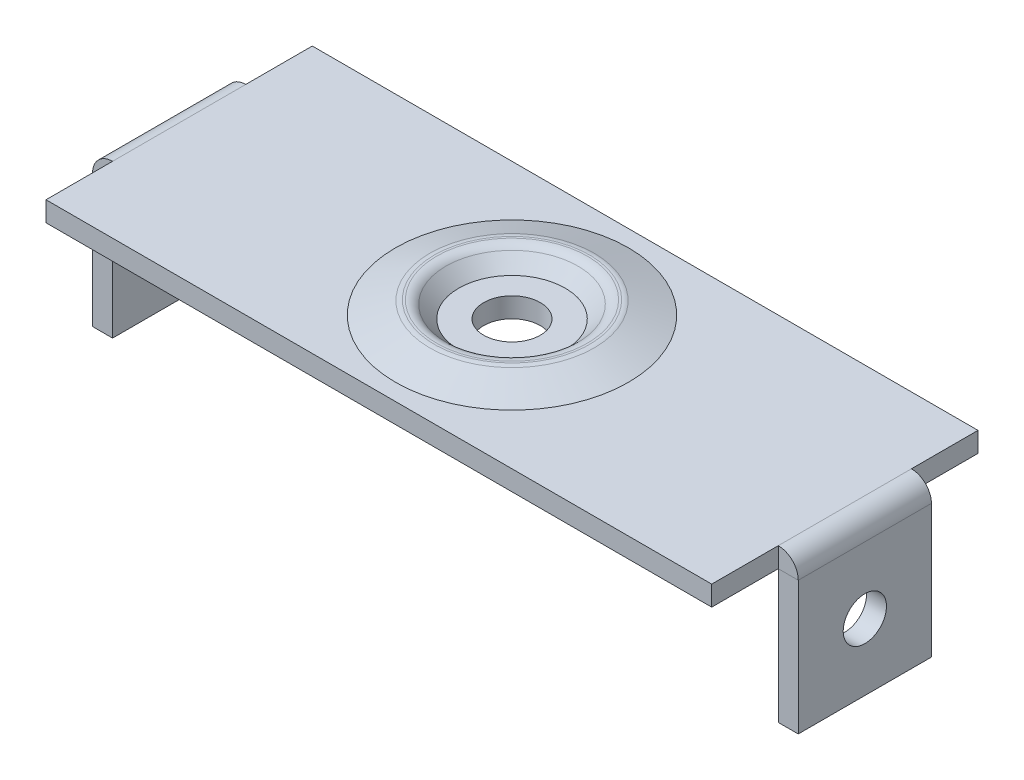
ISO-10303-21;
HEADER;
FILE_DESCRIPTION(('STEP AP214'),'2;1');
FILE_NAME('part.step','',(''),(''),'','','');
FILE_SCHEMA(('AUTOMOTIVE_DESIGN { 1 0 10303 214 1 1 1 1 }'));
ENDSEC;
DATA;
#1=APPLICATION_CONTEXT('core data for automotive mechanical design processes');
#2=APPLICATION_PROTOCOL_DEFINITION('international standard','automotive_design',2000,#1);
#3=PRODUCT_CONTEXT('',#1,'mechanical');
#4=PRODUCT('Part','Part','',(#3));
#5=PRODUCT_RELATED_PRODUCT_CATEGORY('part','',(#4));
#6=PRODUCT_DEFINITION_FORMATION('','',#4);
#7=PRODUCT_DEFINITION_CONTEXT('part definition',#1,'design');
#8=PRODUCT_DEFINITION('design','',#6,#7);
#9=PRODUCT_DEFINITION_SHAPE('','',#8);
#10=(LENGTH_UNIT() NAMED_UNIT(*) SI_UNIT(.MILLI.,.METRE.));
#11=(NAMED_UNIT(*) PLANE_ANGLE_UNIT() SI_UNIT($,.RADIAN.));
#12=(NAMED_UNIT(*) SI_UNIT($,.STERADIAN.) SOLID_ANGLE_UNIT());
#13=UNCERTAINTY_MEASURE_WITH_UNIT(LENGTH_MEASURE(1.E-05),#10,'distance_accuracy_value','');
#14=(GEOMETRIC_REPRESENTATION_CONTEXT(3) GLOBAL_UNCERTAINTY_ASSIGNED_CONTEXT((#13)) GLOBAL_UNIT_ASSIGNED_CONTEXT((#10,
#11,#12)) REPRESENTATION_CONTEXT('',''));
#15=CARTESIAN_POINT('',(0.,0.,0.));
#16=DIRECTION('',(0.,0.,1.));
#17=DIRECTION('',(1.,0.,0.));
#18=AXIS2_PLACEMENT_3D('',#15,#16,#17);
#19=CARTESIAN_POINT('',(53.,-21.5,10.));
#20=DIRECTION('',(1.,0.,0.));
#21=DIRECTION('',(0.,1.,0.));
#22=AXIS2_PLACEMENT_3D('',#19,#20,#21);
#23=PLANE('',#22);
#24=CARTESIAN_POINT('',(53.,-11.5,0.));
#25=DIRECTION('',(1.,0.,0.));
#26=DIRECTION('',(0.,1.,0.));
#27=AXIS2_PLACEMENT_3D('',#24,#25,#26);
#28=CIRCLE('',#27,3.25);
#29=CARTESIAN_POINT('',(53.,-8.24999999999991,1.11202713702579E-13));
#30=VERTEX_POINT('',#29);
#31=EDGE_CURVE('E198',#30,#30,#28,.T.);
#32=ORIENTED_EDGE('',*,*,#31,.F.);
#33=EDGE_LOOP('',(#32));
#34=FACE_BOUND('',#33,.T.);
#35=DIRECTION('',(0.,1.,0.));
#36=VECTOR('',#35,1.);
#37=CARTESIAN_POINT('',(53.,-21.5,-9.9999999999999));
#38=LINE('',#37,#36);
#39=CARTESIAN_POINT('',(53.,-21.5,-9.9999999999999));
#40=VERTEX_POINT('',#39);
#41=CARTESIAN_POINT('',(53.,-1.49999999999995,-9.99999999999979));
#42=VERTEX_POINT('',#41);
#43=EDGE_CURVE('E192',#40,#42,#38,.T.);
#44=ORIENTED_EDGE('',*,*,#43,.T.);
#45=DIRECTION('',(0.,0.,1.));
#46=VECTOR('',#45,1.);
#47=CARTESIAN_POINT('',(53.,-1.49999999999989,20.0000000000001));
#48=LINE('',#47,#46);
#49=CARTESIAN_POINT('',(53.,-1.5,10.0000000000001));
#50=VERTEX_POINT('',#49);
#51=EDGE_CURVE('E190',#42,#50,#48,.T.);
#52=ORIENTED_EDGE('',*,*,#51,.T.);
#53=DIRECTION('',(0.,1.,0.));
#54=VECTOR('',#53,1.);
#55=CARTESIAN_POINT('',(53.,-21.5,10.));
#56=LINE('',#55,#54);
#57=CARTESIAN_POINT('',(53.,-21.5,10.));
#58=VERTEX_POINT('',#57);
#59=EDGE_CURVE('E54',#58,#50,#56,.T.);
#60=ORIENTED_EDGE('',*,*,#59,.F.);
#61=DIRECTION('',(0.,0.,1.));
#62=VECTOR('',#61,1.);
#63=CARTESIAN_POINT('',(53.,-21.5,10.));
#64=LINE('',#63,#62);
#65=EDGE_CURVE('E195',#58,#40,#64,.F.);
#66=ORIENTED_EDGE('',*,*,#65,.T.);
#67=EDGE_LOOP('',(#44,#52,#60,#66));
#68=FACE_BOUND('',#67,.T.);
#69=ADVANCED_FACE('F29',(#34,#68),#23,.T.);
#70=CARTESIAN_POINT('',(-53.000025,-11.4999999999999,1.11022302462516E-13));
#71=DIRECTION('',(1.,0.,0.));
#72=DIRECTION('',(0.,1.,0.));
#73=AXIS2_PLACEMENT_3D('',#70,#71,#72);
#74=CYLINDRICAL_SURFACE('',#73,3.25);
#75=CARTESIAN_POINT('',(50.,-11.4999999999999,1.11022302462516E-13));
#76=DIRECTION('',(1.,0.,0.));
#77=DIRECTION('',(0.,1.,0.));
#78=AXIS2_PLACEMENT_3D('',#75,#76,#77);
#79=CIRCLE('',#78,3.25);
#80=CARTESIAN_POINT('',(50.,-8.24999999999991,1.1120271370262E-13));
#81=VERTEX_POINT('',#80);
#82=EDGE_CURVE('E176',#81,#81,#79,.T.);
#83=CARTESIAN_POINT('',(53.,-8.24999999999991,1.11202713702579E-13));
#84=CARTESIAN_POINT('',(52.96875,-8.24999999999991,1.1120271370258E-13));
#85=CARTESIAN_POINT('',(52.9375,-8.24999999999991,1.1120271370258E-13));
#86=CARTESIAN_POINT('',(52.875,-8.24999999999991,1.11202713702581E-13));
#87=CARTESIAN_POINT('',(52.84375,-8.24999999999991,1.11202713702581E-13));
#88=CARTESIAN_POINT('',(52.78125,-8.24999999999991,1.11202713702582E-13));
#89=CARTESIAN_POINT('',(52.75,-8.24999999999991,1.11202713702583E-13));
#90=CARTESIAN_POINT('',(52.6875,-8.24999999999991,1.11202713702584E-13));
#91=CARTESIAN_POINT('',(52.65625,-8.24999999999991,1.11202713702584E-13));
#92=CARTESIAN_POINT('',(52.59375,-8.24999999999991,1.11202713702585E-13));
#93=CARTESIAN_POINT('',(52.5625,-8.24999999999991,1.11202713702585E-13));
#94=CARTESIAN_POINT('',(52.5,-8.24999999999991,1.11202713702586E-13));
#95=CARTESIAN_POINT('',(52.46875,-8.24999999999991,1.11202713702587E-13));
#96=CARTESIAN_POINT('',(52.40625,-8.24999999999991,1.11202713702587E-13));
#97=CARTESIAN_POINT('',(52.375,-8.24999999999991,1.11202713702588E-13));
#98=CARTESIAN_POINT('',(52.3125,-8.24999999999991,1.11202713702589E-13));
#99=CARTESIAN_POINT('',(52.28125,-8.24999999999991,1.11202713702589E-13));
#100=CARTESIAN_POINT('',(52.21875,-8.24999999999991,1.1120271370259E-13));
#101=CARTESIAN_POINT('',(52.1875,-8.24999999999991,1.1120271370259E-13));
#102=CARTESIAN_POINT('',(52.125,-8.24999999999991,1.11202713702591E-13));
#103=CARTESIAN_POINT('',(52.09375,-8.24999999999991,1.11202713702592E-13));
#104=CARTESIAN_POINT('',(52.03125,-8.24999999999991,1.11202713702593E-13));
#105=CARTESIAN_POINT('',(52.,-8.24999999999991,1.11202713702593E-13));
#106=CARTESIAN_POINT('',(51.9375,-8.24999999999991,1.11202713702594E-13));
#107=CARTESIAN_POINT('',(51.90625,-8.24999999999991,1.11202713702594E-13));
#108=CARTESIAN_POINT('',(51.84375,-8.24999999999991,1.11202713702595E-13));
#109=CARTESIAN_POINT('',(51.8125,-8.24999999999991,1.11202713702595E-13));
#110=CARTESIAN_POINT('',(51.75,-8.24999999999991,1.11202713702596E-13));
#111=CARTESIAN_POINT('',(51.71875,-8.24999999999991,1.11202713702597E-13));
#112=CARTESIAN_POINT('',(51.65625,-8.24999999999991,1.11202713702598E-13));
#113=CARTESIAN_POINT('',(51.625,-8.24999999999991,1.11202713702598E-13));
#114=CARTESIAN_POINT('',(51.5625,-8.24999999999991,1.11202713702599E-13));
#115=CARTESIAN_POINT('',(51.53125,-8.24999999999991,1.11202713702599E-13));
#116=CARTESIAN_POINT('',(51.46875,-8.24999999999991,1.112027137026E-13));
#117=CARTESIAN_POINT('',(51.4375,-8.24999999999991,1.11202713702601E-13));
#118=CARTESIAN_POINT('',(51.375,-8.24999999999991,1.11202713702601E-13));
#119=CARTESIAN_POINT('',(51.34375,-8.24999999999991,1.11202713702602E-13));
#120=CARTESIAN_POINT('',(51.28125,-8.24999999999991,1.11202713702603E-13));
#121=CARTESIAN_POINT('',(51.25,-8.24999999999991,1.11202713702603E-13));
#122=CARTESIAN_POINT('',(51.1875,-8.24999999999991,1.11202713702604E-13));
#123=CARTESIAN_POINT('',(51.15625,-8.24999999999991,1.11202713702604E-13));
#124=CARTESIAN_POINT('',(51.09375,-8.24999999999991,1.11202713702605E-13));
#125=CARTESIAN_POINT('',(51.0625,-8.24999999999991,1.11202713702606E-13));
#126=CARTESIAN_POINT('',(51.,-8.24999999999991,1.11202713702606E-13));
#127=CARTESIAN_POINT('',(50.96875,-8.24999999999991,1.11202713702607E-13));
#128=CARTESIAN_POINT('',(50.90625,-8.24999999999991,1.11202713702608E-13));
#129=CARTESIAN_POINT('',(50.875,-8.24999999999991,1.11202713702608E-13));
#130=CARTESIAN_POINT('',(50.8125,-8.24999999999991,1.11202713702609E-13));
#131=CARTESIAN_POINT('',(50.78125,-8.24999999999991,1.11202713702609E-13));
#132=CARTESIAN_POINT('',(50.71875,-8.24999999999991,1.1120271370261E-13));
#133=CARTESIAN_POINT('',(50.6875,-8.24999999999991,1.11202713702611E-13));
#134=CARTESIAN_POINT('',(50.625,-8.24999999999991,1.11202713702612E-13));
#135=CARTESIAN_POINT('',(50.59375,-8.24999999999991,1.11202713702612E-13));
#136=CARTESIAN_POINT('',(50.53125,-8.24999999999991,1.11202713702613E-13));
#137=CARTESIAN_POINT('',(50.5,-8.24999999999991,1.11202713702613E-13));
#138=CARTESIAN_POINT('',(50.4375,-8.24999999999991,1.11202713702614E-13));
#139=CARTESIAN_POINT('',(50.40625,-8.24999999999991,1.11202713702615E-13));
#140=CARTESIAN_POINT('',(50.34375,-8.24999999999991,1.11202713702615E-13));
#141=CARTESIAN_POINT('',(50.3125,-8.24999999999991,1.11202713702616E-13));
#142=CARTESIAN_POINT('',(50.25,-8.24999999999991,1.11202713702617E-13));
#143=CARTESIAN_POINT('',(50.21875,-8.24999999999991,1.11202713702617E-13));
#144=CARTESIAN_POINT('',(50.15625,-8.24999999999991,1.11202713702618E-13));
#145=CARTESIAN_POINT('',(50.125,-8.24999999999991,1.11202713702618E-13));
#146=CARTESIAN_POINT('',(50.0625,-8.24999999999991,1.11202713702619E-13));
#147=CARTESIAN_POINT('',(50.03125,-8.24999999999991,1.1120271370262E-13));
#148=CARTESIAN_POINT('',(50.,-8.24999999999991,1.1120271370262E-13));
#149=B_SPLINE_CURVE_WITH_KNOTS('',3,(#83,#84,#85,#86,#87,#88,#89,#90,#91,#92,#93,#94,#95,#96,
#97,#98,#99,#100,#101,#102,#103,#104,#105,#106,#107,#108,#109,#110,#111,#112,#113,#114,#115,
#116,#117,#118,#119,#120,#121,#122,#123,#124,#125,#126,#127,#128,#129,#130,#131,#132,#133,#134,
#135,#136,#137,#138,#139,#140,#141,#142,#143,#144,#145,#146,#147,#148),.UNSPECIFIED.,.F.,.F.,(4,
2,2,2,2,2,2,2,2,2,2,2,2,2,2,2,2,2,2,2,2,2,2,2,2,2,2,2,2,2,2,2,4),(0.,0.0937500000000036,
0.187500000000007,0.281249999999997,0.375,0.468750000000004,0.562499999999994,0.656249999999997,
0.750000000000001,0.843750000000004,0.937500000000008,1.03125,1.125,1.21875,1.31249999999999,
1.40625,1.5,1.59375,1.68750000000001,1.78125,1.875,1.96875000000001,2.06249999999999,2.15625,
2.25,2.34375000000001,2.43750000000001,2.53125,2.625,2.71875000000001,2.8125,2.90625,3.),.UNSPECIFIED.);
#150=EDGE_CURVE('BSEAM427',#30,#81,#149,.T.);
#151=ORIENTED_EDGE('',*,*,#31,.T.);
#152=ORIENTED_EDGE('',*,*,#82,.F.);
#153=ORIENTED_EDGE('',*,*,#150,.T.);
#154=ORIENTED_EDGE('',*,*,#150,.F.);
#155=EDGE_LOOP('',(#151,#153,#152,#154));
#156=FACE_BOUND('',#155,.T.);
#157=ADVANCED_FACE('F427',(#156),#74,.F.);
#158=CARTESIAN_POINT('',(50.,-21.4999999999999,10.0000000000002));
#159=DIRECTION('',(1.,0.,0.));
#160=DIRECTION('',(0.,1.,0.));
#161=AXIS2_PLACEMENT_3D('',#158,#159,#160);
#162=PLANE('',#161);
#163=ORIENTED_EDGE('',*,*,#82,.T.);
#164=EDGE_LOOP('',(#163));
#165=FACE_BOUND('',#164,.T.);
#166=DIRECTION('',(0.,1.,0.));
#167=VECTOR('',#166,1.);
#168=CARTESIAN_POINT('',(50.,-21.4999999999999,10.0000000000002));
#169=LINE('',#168,#167);
#170=CARTESIAN_POINT('',(50.,-21.4999999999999,10.0000000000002));
#171=VERTEX_POINT('',#170);
#172=CARTESIAN_POINT('',(50.,-1.49999999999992,10.0000000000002));
#173=VERTEX_POINT('',#172);
#174=EDGE_CURVE('E174',#171,#173,#169,.T.);
#175=ORIENTED_EDGE('',*,*,#174,.T.);
#176=DIRECTION('',(0.,0.,-1.));
#177=VECTOR('',#176,1.);
#178=CARTESIAN_POINT('',(50.,-1.49999999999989,20.0000000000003));
#179=LINE('',#178,#177);
#180=CARTESIAN_POINT('',(50.,-1.49999999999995,-9.99999999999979));
#181=VERTEX_POINT('',#180);
#182=EDGE_CURVE('E160',#173,#181,#179,.T.);
#183=ORIENTED_EDGE('',*,*,#182,.T.);
#184=DIRECTION('',(0.,1.,0.));
#185=VECTOR('',#184,1.);
#186=CARTESIAN_POINT('',(50.,-21.5,-9.99999999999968));
#187=LINE('',#186,#185);
#188=CARTESIAN_POINT('',(50.,-21.5,-9.99999999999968));
#189=VERTEX_POINT('',#188);
#190=EDGE_CURVE('E167',#189,#181,#187,.T.);
#191=ORIENTED_EDGE('',*,*,#190,.F.);
#192=DIRECTION('',(0.,0.,-1.));
#193=VECTOR('',#192,1.);
#194=CARTESIAN_POINT('',(50.,-21.4999999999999,10.0000000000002));
#195=LINE('',#194,#193);
#196=EDGE_CURVE('E46',#171,#189,#195,.T.);
#197=ORIENTED_EDGE('',*,*,#196,.F.);
#198=EDGE_LOOP('',(#175,#183,#191,#197));
#199=FACE_BOUND('',#198,.T.);
#200=ADVANCED_FACE('F172',(#165,#199),#162,.F.);
#201=CARTESIAN_POINT('',(-3.5685424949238,-21.4999999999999,10.0000000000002));
#202=DIRECTION('',(0.,0.,-1.));
#203=DIRECTION('',(0.,1.,0.));
#204=AXIS2_PLACEMENT_3D('',#201,#202,#203);
#205=PLANE('',#204);
#206=ORIENTED_EDGE('',*,*,#59,.T.);
#207=DIRECTION('',(1.,0.,0.));
#208=VECTOR('',#207,1.);
#209=CARTESIAN_POINT('',(-3.56854249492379,-1.49999999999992,10.0000000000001));
#210=LINE('',#209,#208);
#211=EDGE_CURVE('E11',#173,#50,#210,.T.);
#212=ORIENTED_EDGE('',*,*,#211,.F.);
#213=ORIENTED_EDGE('',*,*,#174,.F.);
#214=DIRECTION('',(1.,0.,0.));
#215=VECTOR('',#214,1.);
#216=CARTESIAN_POINT('',(-3.5685424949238,-21.4999999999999,10.0000000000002));
#217=LINE('',#216,#215);
#218=EDGE_CURVE('E187',#171,#58,#217,.T.);
#219=ORIENTED_EDGE('',*,*,#218,.T.);
#220=EDGE_LOOP('',(#206,#212,#213,#219));
#221=FACE_BOUND('',#220,.T.);
#222=ADVANCED_FACE('F31',(#221),#205,.F.);
#223=CARTESIAN_POINT('',(-3.56854249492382,-21.4999999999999,-9.99999999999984));
#224=DIRECTION('',(0.,0.,-1.));
#225=DIRECTION('',(0.,1.,0.));
#226=AXIS2_PLACEMENT_3D('',#223,#224,#225);
#227=PLANE('',#226);
#228=DIRECTION('',(1.,0.,0.));
#229=VECTOR('',#228,1.);
#230=CARTESIAN_POINT('',(-3.56854249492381,-1.49999999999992,-9.9999999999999));
#231=LINE('',#230,#229);
#232=EDGE_CURVE('E38',#181,#42,#231,.T.);
#233=ORIENTED_EDGE('',*,*,#232,.T.);
#234=ORIENTED_EDGE('',*,*,#43,.F.);
#235=DIRECTION('',(1.,0.,0.));
#236=VECTOR('',#235,1.);
#237=CARTESIAN_POINT('',(-3.56854249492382,-21.4999999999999,-9.99999999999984));
#238=LINE('',#237,#236);
#239=EDGE_CURVE('E141',#189,#40,#238,.T.);
#240=ORIENTED_EDGE('',*,*,#239,.F.);
#241=ORIENTED_EDGE('',*,*,#190,.T.);
#242=EDGE_LOOP('',(#233,#234,#240,#241));
#243=FACE_BOUND('',#242,.T.);
#244=ADVANCED_FACE('F168',(#243),#227,.T.);
#245=CARTESIAN_POINT('',(-3.5685424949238,-21.4999999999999,10.0000000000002));
#246=DIRECTION('',(0.,-1.,0.));
#247=DIRECTION('',(1.,0.,0.));
#248=AXIS2_PLACEMENT_3D('',#245,#246,#247);
#249=PLANE('',#248);
#250=ORIENTED_EDGE('',*,*,#239,.T.);
#251=ORIENTED_EDGE('',*,*,#65,.F.);
#252=ORIENTED_EDGE('',*,*,#218,.F.);
#253=ORIENTED_EDGE('',*,*,#196,.T.);
#254=EDGE_LOOP('',(#250,#251,#252,#253));
#255=FACE_BOUND('',#254,.T.);
#256=ADVANCED_FACE('F449',(#255),#249,.T.);
#257=CARTESIAN_POINT('',(50.,-213.90659228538,20.0000000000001));
#258=DIRECTION('',(1.,0.,0.));
#259=DIRECTION('',(0.,1.,0.));
#260=AXIS2_PLACEMENT_3D('',#257,#258,#259);
#261=PLANE('',#260);
#262=DIRECTION('',(0.,0.,-1.));
#263=VECTOR('',#262,1.);
#264=CARTESIAN_POINT('',(50.,-1.49999999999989,20.0000000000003));
#265=LINE('',#264,#263);
#266=CARTESIAN_POINT('',(50.,-1.49999999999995,20.0000000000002));
#267=VERTEX_POINT('',#266);
#268=EDGE_CURVE('E164',#267,#173,#265,.T.);
#269=ORIENTED_EDGE('',*,*,#268,.T.);
#270=DIRECTION('',(0.,-1.,0.));
#271=VECTOR('',#270,1.);
#272=CARTESIAN_POINT('',(50.,1.38777878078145E-13,10.));
#273=LINE('',#272,#271);
#274=CARTESIAN_POINT('',(50.,1.50000000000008,10.0000000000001));
#275=VERTEX_POINT('',#274);
#276=EDGE_CURVE('E153',#173,#275,#273,.F.);
#277=ORIENTED_EDGE('',*,*,#276,.T.);
#278=DIRECTION('',(0.,0.,-1.));
#279=VECTOR('',#278,1.);
#280=CARTESIAN_POINT('',(50.,1.50000000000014,20.0000000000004));
#281=LINE('',#280,#279);
#282=CARTESIAN_POINT('',(50.,1.50000000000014,20.0000000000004));
#283=VERTEX_POINT('',#282);
#284=EDGE_CURVE('E288',#283,#275,#281,.T.);
#285=ORIENTED_EDGE('',*,*,#284,.F.);
#286=DIRECTION('',(0.,1.,0.));
#287=VECTOR('',#286,1.);
#288=CARTESIAN_POINT('',(50.,-213.90659228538,20.0000000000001));
#289=LINE('',#288,#287);
#290=EDGE_CURVE('E302',#267,#283,#289,.T.);
#291=ORIENTED_EDGE('',*,*,#290,.F.);
#292=EDGE_LOOP('',(#269,#277,#285,#291));
#293=FACE_BOUND('',#292,.T.);
#294=ADVANCED_FACE('F540',(#293),#261,.T.);
#295=CARTESIAN_POINT('',(-53.,-21.5,10.0000000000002));
#296=DIRECTION('',(1.,0.,0.));
#297=DIRECTION('',(0.,1.,0.));
#298=AXIS2_PLACEMENT_3D('',#295,#296,#297);
#299=PLANE('',#298);
#300=CARTESIAN_POINT('',(-53.,-11.4999999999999,1.11022302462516E-13));
#301=DIRECTION('',(1.,0.,0.));
#302=DIRECTION('',(0.,1.,0.));
#303=AXIS2_PLACEMENT_3D('',#300,#301,#302);
#304=CIRCLE('',#303,3.25);
#305=CARTESIAN_POINT('',(-53.,-8.2499999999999,1.11202713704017E-13));
#306=VERTEX_POINT('',#305);
#307=EDGE_CURVE('E245',#306,#306,#304,.T.);
#308=ORIENTED_EDGE('',*,*,#307,.T.);
#309=EDGE_LOOP('',(#308));
#310=FACE_BOUND('',#309,.T.);
#311=DIRECTION('',(0.,1.,0.));
#312=VECTOR('',#311,1.);
#313=CARTESIAN_POINT('',(-53.,-21.5,10.0000000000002));
#314=LINE('',#313,#312);
#315=CARTESIAN_POINT('',(-53.,-21.5,10.0000000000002));
#316=VERTEX_POINT('',#315);
#317=CARTESIAN_POINT('',(-53.,-1.49999999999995,10.0000000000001));
#318=VERTEX_POINT('',#317);
#319=EDGE_CURVE('E254',#316,#318,#314,.T.);
#320=ORIENTED_EDGE('',*,*,#319,.T.);
#321=DIRECTION('',(0.,0.,-1.));
#322=VECTOR('',#321,1.);
#323=CARTESIAN_POINT('',(-53.,-1.50000000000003,20.0000000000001));
#324=LINE('',#323,#322);
#325=CARTESIAN_POINT('',(-53.,-1.49999999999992,-9.9999999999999));
#326=VERTEX_POINT('',#325);
#327=EDGE_CURVE('E257',#318,#326,#324,.T.);
#328=ORIENTED_EDGE('',*,*,#327,.T.);
#329=DIRECTION('',(0.,1.,0.));
#330=VECTOR('',#329,1.);
#331=CARTESIAN_POINT('',(-53.,-21.5,-10.));
#332=LINE('',#331,#330);
#333=CARTESIAN_POINT('',(-53.,-21.5,-10.));
#334=VERTEX_POINT('',#333);
#335=EDGE_CURVE('E248',#334,#326,#332,.T.);
#336=ORIENTED_EDGE('',*,*,#335,.F.);
#337=DIRECTION('',(0.,0.,1.));
#338=VECTOR('',#337,1.);
#339=CARTESIAN_POINT('',(-53.,-21.5,10.0000000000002));
#340=LINE('',#339,#338);
#341=EDGE_CURVE('E251',#316,#334,#340,.F.);
#342=ORIENTED_EDGE('',*,*,#341,.F.);
#343=EDGE_LOOP('',(#320,#328,#336,#342));
#344=FACE_BOUND('',#343,.T.);
#345=ADVANCED_FACE('F415',(#310,#344),#299,.F.);
#346=CARTESIAN_POINT('',(-53.000025,-11.4999999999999,1.11022302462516E-13));
#347=DIRECTION('',(1.,0.,0.));
#348=DIRECTION('',(0.,1.,0.));
#349=AXIS2_PLACEMENT_3D('',#346,#347,#348);
#350=CYLINDRICAL_SURFACE('',#349,3.25);
#351=CARTESIAN_POINT('',(-50.,-11.5,0.));
#352=DIRECTION('',(1.,0.,0.));
#353=DIRECTION('',(0.,1.,0.));
#354=AXIS2_PLACEMENT_3D('',#351,#352,#353);
#355=CIRCLE('',#354,3.25);
#356=CARTESIAN_POINT('',(-50.,-8.2499999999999,1.11202713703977E-13));
#357=VERTEX_POINT('',#356);
#358=EDGE_CURVE('E235',#357,#357,#355,.T.);
#359=CARTESIAN_POINT('',(-50.,-8.2499999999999,1.11202713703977E-13));
#360=CARTESIAN_POINT('',(-50.03125,-8.2499999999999,1.11202713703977E-13));
#361=CARTESIAN_POINT('',(-50.0625,-8.2499999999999,1.11202713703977E-13));
#362=CARTESIAN_POINT('',(-50.125,-8.2499999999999,1.11202713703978E-13));
#363=CARTESIAN_POINT('',(-50.15625,-8.2499999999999,1.11202713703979E-13));
#364=CARTESIAN_POINT('',(-50.21875,-8.2499999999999,1.1120271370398E-13));
#365=CARTESIAN_POINT('',(-50.25,-8.2499999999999,1.1120271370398E-13));
#366=CARTESIAN_POINT('',(-50.3125,-8.2499999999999,1.11202713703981E-13));
#367=CARTESIAN_POINT('',(-50.34375,-8.2499999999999,1.11202713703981E-13));
#368=CARTESIAN_POINT('',(-50.40625,-8.2499999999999,1.11202713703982E-13));
#369=CARTESIAN_POINT('',(-50.4375,-8.2499999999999,1.11202713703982E-13));
#370=CARTESIAN_POINT('',(-50.5,-8.2499999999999,1.11202713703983E-13));
#371=CARTESIAN_POINT('',(-50.53125,-8.2499999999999,1.11202713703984E-13));
#372=CARTESIAN_POINT('',(-50.59375,-8.2499999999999,1.11202713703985E-13));
#373=CARTESIAN_POINT('',(-50.625,-8.2499999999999,1.11202713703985E-13));
#374=CARTESIAN_POINT('',(-50.6875,-8.2499999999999,1.11202713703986E-13));
#375=CARTESIAN_POINT('',(-50.71875,-8.2499999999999,1.11202713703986E-13));
#376=CARTESIAN_POINT('',(-50.78125,-8.2499999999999,1.11202713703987E-13));
#377=CARTESIAN_POINT('',(-50.8125,-8.2499999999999,1.11202713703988E-13));
#378=CARTESIAN_POINT('',(-50.875,-8.2499999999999,1.11202713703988E-13));
#379=CARTESIAN_POINT('',(-50.90625,-8.2499999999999,1.11202713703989E-13));
#380=CARTESIAN_POINT('',(-50.96875,-8.2499999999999,1.1120271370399E-13));
#381=CARTESIAN_POINT('',(-51.,-8.2499999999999,1.1120271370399E-13));
#382=CARTESIAN_POINT('',(-51.0625,-8.2499999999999,1.11202713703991E-13));
#383=CARTESIAN_POINT('',(-51.09375,-8.2499999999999,1.11202713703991E-13));
#384=CARTESIAN_POINT('',(-51.15625,-8.2499999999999,1.11202713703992E-13));
#385=CARTESIAN_POINT('',(-51.1875,-8.2499999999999,1.11202713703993E-13));
#386=CARTESIAN_POINT('',(-51.25,-8.2499999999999,1.11202713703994E-13));
#387=CARTESIAN_POINT('',(-51.28125,-8.2499999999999,1.11202713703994E-13));
#388=CARTESIAN_POINT('',(-51.34375,-8.2499999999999,1.11202713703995E-13));
#389=CARTESIAN_POINT('',(-51.375,-8.2499999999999,1.11202713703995E-13));
#390=CARTESIAN_POINT('',(-51.4375,-8.2499999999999,1.11202713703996E-13));
#391=CARTESIAN_POINT('',(-51.46875,-8.2499999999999,1.11202713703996E-13));
#392=CARTESIAN_POINT('',(-51.53125,-8.2499999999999,1.11202713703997E-13));
#393=CARTESIAN_POINT('',(-51.5625,-8.2499999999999,1.11202713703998E-13));
#394=CARTESIAN_POINT('',(-51.625,-8.2499999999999,1.11202713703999E-13));
#395=CARTESIAN_POINT('',(-51.65625,-8.2499999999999,1.11202713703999E-13));
#396=CARTESIAN_POINT('',(-51.71875,-8.2499999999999,1.11202713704E-13));
#397=CARTESIAN_POINT('',(-51.75,-8.2499999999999,1.11202713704E-13));
#398=CARTESIAN_POINT('',(-51.8125,-8.2499999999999,1.11202713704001E-13));
#399=CARTESIAN_POINT('',(-51.84375,-8.2499999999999,1.11202713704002E-13));
#400=CARTESIAN_POINT('',(-51.90625,-8.2499999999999,1.11202713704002E-13));
#401=CARTESIAN_POINT('',(-51.9375,-8.2499999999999,1.11202713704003E-13));
#402=CARTESIAN_POINT('',(-52.,-8.2499999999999,1.11202713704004E-13));
#403=CARTESIAN_POINT('',(-52.03125,-8.2499999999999,1.11202713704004E-13));
#404=CARTESIAN_POINT('',(-52.09375,-8.2499999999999,1.11202713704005E-13));
#405=CARTESIAN_POINT('',(-52.125,-8.2499999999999,1.11202713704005E-13));
#406=CARTESIAN_POINT('',(-52.1875,-8.2499999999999,1.11202713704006E-13));
#407=CARTESIAN_POINT('',(-52.21875,-8.2499999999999,1.11202713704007E-13));
#408=CARTESIAN_POINT('',(-52.28125,-8.2499999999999,1.11202713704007E-13));
#409=CARTESIAN_POINT('',(-52.3125,-8.2499999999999,1.11202713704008E-13));
#410=CARTESIAN_POINT('',(-52.375,-8.2499999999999,1.11202713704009E-13));
#411=CARTESIAN_POINT('',(-52.40625,-8.2499999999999,1.11202713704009E-13));
#412=CARTESIAN_POINT('',(-52.46875,-8.2499999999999,1.1120271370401E-13));
#413=CARTESIAN_POINT('',(-52.5,-8.2499999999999,1.1120271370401E-13));
#414=CARTESIAN_POINT('',(-52.5625,-8.2499999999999,1.11202713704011E-13));
#415=CARTESIAN_POINT('',(-52.59375,-8.2499999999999,1.11202713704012E-13));
#416=CARTESIAN_POINT('',(-52.65625,-8.2499999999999,1.11202713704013E-13));
#417=CARTESIAN_POINT('',(-52.6875,-8.2499999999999,1.11202713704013E-13));
#418=CARTESIAN_POINT('',(-52.75,-8.2499999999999,1.11202713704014E-13));
#419=CARTESIAN_POINT('',(-52.78125,-8.2499999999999,1.11202713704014E-13));
#420=CARTESIAN_POINT('',(-52.84375,-8.2499999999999,1.11202713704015E-13));
#421=CARTESIAN_POINT('',(-52.875,-8.2499999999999,1.11202713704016E-13));
#422=CARTESIAN_POINT('',(-52.9375,-8.2499999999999,1.11202713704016E-13));
#423=CARTESIAN_POINT('',(-52.96875,-8.2499999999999,1.11202713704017E-13));
#424=CARTESIAN_POINT('',(-53.,-8.2499999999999,1.11202713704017E-13));
#425=B_SPLINE_CURVE_WITH_KNOTS('',3,(#359,#360,#361,#362,#363,#364,#365,#366,#367,#368,#369,
#370,#371,#372,#373,#374,#375,#376,#377,#378,#379,#380,#381,#382,#383,#384,#385,#386,#387,#388,
#389,#390,#391,#392,#393,#394,#395,#396,#397,#398,#399,#400,#401,#402,#403,#404,#405,#406,#407,
#408,#409,#410,#411,#412,#413,#414,#415,#416,#417,#418,#419,#420,#421,#422,#423,#424),
.UNSPECIFIED.,.F.,.F.,(4,2,2,2,2,2,2,2,2,2,2,2,2,2,2,2,2,2,2,2,2,2,2,2,2,2,2,2,2,2,2,2,4),(0.,
0.0937499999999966,0.1875,0.281249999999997,0.375,0.468749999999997,0.5625,0.656249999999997,
0.750000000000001,0.843749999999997,0.937500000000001,1.03125,1.125,1.21875,1.3125,1.40625,1.5,
1.59375,1.6875,1.78125,1.875,1.96875,2.0625,2.15625,2.25,2.34375,2.4375,2.53125,2.625,2.71875,
2.8125,2.90625,3.),.UNSPECIFIED.);
#426=EDGE_CURVE('BSEAM545',#357,#306,#425,.T.);
#427=ORIENTED_EDGE('',*,*,#358,.T.);
#428=ORIENTED_EDGE('',*,*,#307,.F.);
#429=ORIENTED_EDGE('',*,*,#426,.T.);
#430=ORIENTED_EDGE('',*,*,#426,.F.);
#431=EDGE_LOOP('',(#427,#429,#428,#430));
#432=FACE_BOUND('',#431,.T.);
#433=ADVANCED_FACE('F545',(#432),#350,.F.);
#434=CARTESIAN_POINT('',(-50.,-21.5,10.0000000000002));
#435=DIRECTION('',(1.,0.,0.));
#436=DIRECTION('',(0.,1.,0.));
#437=AXIS2_PLACEMENT_3D('',#434,#435,#436);
#438=PLANE('',#437);
#439=ORIENTED_EDGE('',*,*,#358,.F.);
#440=EDGE_LOOP('',(#439));
#441=FACE_BOUND('',#440,.T.);
#442=DIRECTION('',(0.,0.,-1.));
#443=VECTOR('',#442,1.);
#444=CARTESIAN_POINT('',(-50.,-1.50000000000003,20.0000000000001));
#445=LINE('',#444,#443);
#446=CARTESIAN_POINT('',(-50.,-1.50000000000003,10.0000000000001));
#447=VERTEX_POINT('',#446);
#448=CARTESIAN_POINT('',(-50.,-1.49999999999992,-9.9999999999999));
#449=VERTEX_POINT('',#448);
#450=EDGE_CURVE('E238',#447,#449,#445,.T.);
#451=ORIENTED_EDGE('',*,*,#450,.F.);
#452=DIRECTION('',(0.,1.,0.));
#453=VECTOR('',#452,1.);
#454=CARTESIAN_POINT('',(-50.,-21.5,10.0000000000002));
#455=LINE('',#454,#453);
#456=CARTESIAN_POINT('',(-50.,-21.5,10.0000000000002));
#457=VERTEX_POINT('',#456);
#458=EDGE_CURVE('E244',#457,#447,#455,.T.);
#459=ORIENTED_EDGE('',*,*,#458,.F.);
#460=DIRECTION('',(0.,0.,-1.));
#461=VECTOR('',#460,1.);
#462=CARTESIAN_POINT('',(-50.,-21.5,10.0000000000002));
#463=LINE('',#462,#461);
#464=CARTESIAN_POINT('',(-50.,-21.5,-10.));
#465=VERTEX_POINT('',#464);
#466=EDGE_CURVE('E240',#457,#465,#463,.T.);
#467=ORIENTED_EDGE('',*,*,#466,.T.);
#468=DIRECTION('',(0.,1.,0.));
#469=VECTOR('',#468,1.);
#470=CARTESIAN_POINT('',(-50.,-21.5,-10.));
#471=LINE('',#470,#469);
#472=EDGE_CURVE('E243',#465,#449,#471,.T.);
#473=ORIENTED_EDGE('',*,*,#472,.T.);
#474=EDGE_LOOP('',(#451,#459,#467,#473));
#475=FACE_BOUND('',#474,.T.);
#476=ADVANCED_FACE('F410',(#441,#475),#438,.T.);
#477=CARTESIAN_POINT('',(3.5685424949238,-21.5,10.0000000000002));
#478=DIRECTION('',(0.,0.,1.));
#479=DIRECTION('',(0.,1.,0.));
#480=AXIS2_PLACEMENT_3D('',#477,#478,#479);
#481=PLANE('',#480);
#482=ORIENTED_EDGE('',*,*,#319,.F.);
#483=DIRECTION('',(-1.,0.,0.));
#484=VECTOR('',#483,1.);
#485=CARTESIAN_POINT('',(3.5685424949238,-21.5,10.0000000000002));
#486=LINE('',#485,#484);
#487=EDGE_CURVE('E264',#457,#316,#486,.T.);
#488=ORIENTED_EDGE('',*,*,#487,.F.);
#489=ORIENTED_EDGE('',*,*,#458,.T.);
#490=DIRECTION('',(-1.,0.,0.));
#491=VECTOR('',#490,1.);
#492=CARTESIAN_POINT('',(3.5685424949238,-1.49999999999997,10.0000000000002));
#493=LINE('',#492,#491);
#494=EDGE_CURVE('E204',#447,#318,#493,.T.);
#495=ORIENTED_EDGE('',*,*,#494,.T.);
#496=EDGE_LOOP('',(#482,#488,#489,#495));
#497=FACE_BOUND('',#496,.T.);
#498=ADVANCED_FACE('F405',(#497),#481,.T.);
#499=CARTESIAN_POINT('',(3.5685424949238,-21.5,10.0000000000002));
#500=DIRECTION('',(0.,1.,0.));
#501=DIRECTION('',(-1.,0.,0.));
#502=AXIS2_PLACEMENT_3D('',#499,#500,#501);
#503=PLANE('',#502);
#504=ORIENTED_EDGE('',*,*,#487,.T.);
#505=ORIENTED_EDGE('',*,*,#341,.T.);
#506=DIRECTION('',(-1.,0.,0.));
#507=VECTOR('',#506,1.);
#508=CARTESIAN_POINT('',(3.56854249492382,-21.5,-9.99999999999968));
#509=LINE('',#508,#507);
#510=EDGE_CURVE('E261',#465,#334,#509,.T.);
#511=ORIENTED_EDGE('',*,*,#510,.F.);
#512=ORIENTED_EDGE('',*,*,#466,.F.);
#513=EDGE_LOOP('',(#504,#505,#511,#512));
#514=FACE_BOUND('',#513,.T.);
#515=ADVANCED_FACE('F417',(#514),#503,.F.);
#516=CARTESIAN_POINT('',(3.56854249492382,-21.5,-9.99999999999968));
#517=DIRECTION('',(0.,0.,1.));
#518=DIRECTION('',(0.,1.,0.));
#519=AXIS2_PLACEMENT_3D('',#516,#517,#518);
#520=PLANE('',#519);
#521=ORIENTED_EDGE('',*,*,#510,.T.);
#522=ORIENTED_EDGE('',*,*,#335,.T.);
#523=DIRECTION('',(-1.,0.,0.));
#524=VECTOR('',#523,1.);
#525=CARTESIAN_POINT('',(3.56854249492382,-1.49999999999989,-9.99999999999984));
#526=LINE('',#525,#524);
#527=EDGE_CURVE('E260',#449,#326,#526,.T.);
#528=ORIENTED_EDGE('',*,*,#527,.F.);
#529=ORIENTED_EDGE('',*,*,#472,.F.);
#530=EDGE_LOOP('',(#521,#522,#528,#529));
#531=FACE_BOUND('',#530,.T.);
#532=ADVANCED_FACE('F412',(#531),#520,.F.);
#533=CARTESIAN_POINT('',(-50.,-213.90659228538,20.0000000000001));
#534=DIRECTION('',(1.,0.,0.));
#535=DIRECTION('',(0.,1.,0.));
#536=AXIS2_PLACEMENT_3D('',#533,#534,#535);
#537=PLANE('',#536);
#538=DIRECTION('',(0.,1.,0.));
#539=VECTOR('',#538,1.);
#540=CARTESIAN_POINT('',(-50.,-1.50000000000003,10.0000000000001));
#541=LINE('',#540,#539);
#542=CARTESIAN_POINT('',(-50.,1.49999999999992,10.0000000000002));
#543=VERTEX_POINT('',#542);
#544=EDGE_CURVE('E225',#447,#543,#541,.T.);
#545=ORIENTED_EDGE('',*,*,#544,.F.);
#546=DIRECTION('',(0.,0.,-1.));
#547=VECTOR('',#546,1.);
#548=CARTESIAN_POINT('',(-50.,-1.50000000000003,20.0000000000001));
#549=LINE('',#548,#547);
#550=CARTESIAN_POINT('',(-50.,-1.5,20.0000000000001));
#551=VERTEX_POINT('',#550);
#552=EDGE_CURVE('E311',#551,#447,#549,.T.);
#553=ORIENTED_EDGE('',*,*,#552,.F.);
#554=DIRECTION('',(0.,1.,0.));
#555=VECTOR('',#554,1.);
#556=CARTESIAN_POINT('',(-50.,-213.90659228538,20.0000000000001));
#557=LINE('',#556,#555);
#558=CARTESIAN_POINT('',(-50.,1.50000000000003,20.));
#559=VERTEX_POINT('',#558);
#560=EDGE_CURVE('E299',#551,#559,#557,.T.);
#561=ORIENTED_EDGE('',*,*,#560,.T.);
#562=DIRECTION('',(0.,0.,-1.));
#563=VECTOR('',#562,1.);
#564=CARTESIAN_POINT('',(-50.,1.50000000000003,20.));
#565=LINE('',#564,#563);
#566=EDGE_CURVE('E309',#559,#543,#565,.T.);
#567=ORIENTED_EDGE('',*,*,#566,.T.);
#568=EDGE_LOOP('',(#545,#553,#561,#567));
#569=FACE_BOUND('',#568,.T.);
#570=ADVANCED_FACE('F332',(#569),#537,.F.);
#571=CARTESIAN_POINT('',(50.,1.50000000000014,20.0000000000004));
#572=DIRECTION('',(0.,-1.,0.));
#573=DIRECTION('',(1.,0.,0.));
#574=AXIS2_PLACEMENT_3D('',#571,#572,#573);
#575=PLANE('',#574);
#576=CARTESIAN_POINT('',(0.,1.50000000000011,1.66533453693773E-13));
#577=DIRECTION('',(0.,1.,0.));
#578=DIRECTION('',(-1.,0.,0.));
#579=AXIS2_PLACEMENT_3D('',#576,#577,#578);
#580=CIRCLE('',#579,17.5);
#581=CARTESIAN_POINT('',(-17.5,1.50000000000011,1.66533453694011E-13));
#582=VERTEX_POINT('',#581);
#583=EDGE_CURVE('E379',#582,#582,#580,.T.);
#584=ORIENTED_EDGE('',*,*,#583,.F.);
#585=EDGE_LOOP('',(#584));
#586=FACE_BOUND('',#585,.T.);
#587=ORIENTED_EDGE('',*,*,#284,.T.);
#588=DIRECTION('',(0.,0.,1.));
#589=VECTOR('',#588,1.);
#590=CARTESIAN_POINT('',(50.,1.50000000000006,-143.93725028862));
#591=LINE('',#590,#589);
#592=CARTESIAN_POINT('',(50.,1.50000000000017,-9.9999999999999));
#593=VERTEX_POINT('',#592);
#594=EDGE_CURVE('E455',#275,#593,#591,.F.);
#595=ORIENTED_EDGE('',*,*,#594,.T.);
#596=CARTESIAN_POINT('',(50.,1.50000000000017,-19.9999999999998));
#597=VERTEX_POINT('',#596);
#598=EDGE_CURVE('E150',#593,#597,#281,.T.);
#599=ORIENTED_EDGE('',*,*,#598,.T.);
#600=DIRECTION('',(-1.,0.,0.));
#601=VECTOR('',#600,1.);
#602=CARTESIAN_POINT('',(50.,1.50000000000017,-19.9999999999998));
#603=LINE('',#602,#601);
#604=CARTESIAN_POINT('',(-50.,1.49999999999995,-20.));
#605=VERTEX_POINT('',#604);
#606=EDGE_CURVE('E310',#597,#605,#603,.T.);
#607=ORIENTED_EDGE('',*,*,#606,.T.);
#608=CARTESIAN_POINT('',(-50.,1.50000000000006,-9.9999999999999));
#609=VERTEX_POINT('',#608);
#610=EDGE_CURVE('E306',#609,#605,#565,.T.);
#611=ORIENTED_EDGE('',*,*,#610,.F.);
#612=DIRECTION('',(0.,0.,-1.));
#613=VECTOR('',#612,1.);
#614=CARTESIAN_POINT('',(-50.,1.50000000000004,160.23957376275));
#615=LINE('',#614,#613);
#616=EDGE_CURVE('E229',#543,#609,#615,.T.);
#617=ORIENTED_EDGE('',*,*,#616,.F.);
#618=ORIENTED_EDGE('',*,*,#566,.F.);
#619=DIRECTION('',(-1.,0.,0.));
#620=VECTOR('',#619,1.);
#621=CARTESIAN_POINT('',(50.,1.50000000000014,20.0000000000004));
#622=LINE('',#621,#620);
#623=EDGE_CURVE('E289',#283,#559,#622,.T.);
#624=ORIENTED_EDGE('',*,*,#623,.F.);
#625=EDGE_LOOP('',(#587,#595,#599,#607,#611,#617,#618,#624));
#626=FACE_BOUND('',#625,.T.);
#627=ADVANCED_FACE('F386',(#586,#626),#575,.F.);
#628=CARTESIAN_POINT('',(0.,1.50000000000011,1.66533453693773E-13));
#629=DIRECTION('',(0.,-1.,0.));
#630=DIRECTION('',(-1.,0.,0.));
#631=AXIS2_PLACEMENT_3D('',#628,#629,#630);
#632=CONICAL_SURFACE('',#631,17.5,1.22173047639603);
#633=CARTESIAN_POINT('',(0.,3.37938524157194,1.66533453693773E-13));
#634=DIRECTION('',(0.,-1.,0.));
#635=DIRECTION('',(1.,0.,0.));
#636=AXIS2_PLACEMENT_3D('',#633,#634,#635);
#637=CIRCLE('',#636,12.3364314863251);
#638=CARTESIAN_POINT('',(12.3364314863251,3.37938524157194,1.66533453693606E-13));
#639=VERTEX_POINT('',#638);
#640=EDGE_CURVE('E377',#639,#639,#637,.T.);
#641=ORIENTED_EDGE('',*,*,#640,.T.);
#642=EDGE_LOOP('',(#641));
#643=FACE_BOUND('',#642,.T.);
#644=ORIENTED_EDGE('',*,*,#583,.T.);
#645=EDGE_LOOP('',(#644));
#646=FACE_BOUND('',#645,.T.);
#647=ADVANCED_FACE('F526',(#643,#646),#632,.T.);
#648=CARTESIAN_POINT('',(0.,1.50000000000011,1.66533453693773E-13));
#649=DIRECTION('',(0.,1.,0.));
#650=DIRECTION('',(-1.,0.,0.));
#651=AXIS2_PLACEMENT_3D('',#648,#649,#650);
#652=TOROIDAL_SURFACE('',#651,11.6523911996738,2.);
#653=ORIENTED_EDGE('',*,*,#640,.F.);
#654=EDGE_LOOP('',(#653));
#655=FACE_BOUND('',#654,.T.);
#656=CARTESIAN_POINT('',(0.,3.50000000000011,2.22044604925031E-13));
#657=DIRECTION('',(0.,1.,0.));
#658=DIRECTION('',(-1.,0.,0.));
#659=AXIS2_PLACEMENT_3D('',#656,#657,#658);
#660=CIRCLE('',#659,11.6523911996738);
#661=CARTESIAN_POINT('',(-11.6523911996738,3.50000000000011,2.22044604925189E-13));
#662=VERTEX_POINT('',#661);
#663=EDGE_CURVE('E374',#662,#662,#660,.T.);
#664=ORIENTED_EDGE('',*,*,#663,.F.);
#665=EDGE_LOOP('',(#664));
#666=FACE_BOUND('',#665,.T.);
#667=ADVANCED_FACE('F522',(#655,#666),#652,.T.);
#668=CARTESIAN_POINT('',(0.,3.50000000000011,2.22044604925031E-13));
#669=DIRECTION('',(0.,1.,0.));
#670=DIRECTION('',(-1.,0.,0.));
#671=AXIS2_PLACEMENT_3D('',#668,#669,#670);
#672=PLANE('',#671);
#673=ORIENTED_EDGE('',*,*,#663,.T.);
#674=EDGE_LOOP('',(#673));
#675=FACE_BOUND('',#674,.T.);
#676=CARTESIAN_POINT('',(0.,3.50000000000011,2.22044604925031E-13));
#677=DIRECTION('',(0.,1.,0.));
#678=DIRECTION('',(-1.,0.,0.));
#679=AXIS2_PLACEMENT_3D('',#676,#677,#678);
#680=CIRCLE('',#679,11.3284271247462);
#681=CARTESIAN_POINT('',(-11.3284271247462,3.50000000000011,2.22044604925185E-13));
#682=VERTEX_POINT('',#681);
#683=EDGE_CURVE('E371',#682,#682,#680,.F.);
#684=ORIENTED_EDGE('',*,*,#683,.T.);
#685=EDGE_LOOP('',(#684));
#686=FACE_BOUND('',#685,.T.);
#687=ADVANCED_FACE('F518',(#675,#686),#672,.T.);
#688=CARTESIAN_POINT('',(0.,1.50000000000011,1.66533453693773E-13));
#689=DIRECTION('',(0.,1.,0.));
#690=DIRECTION('',(-1.,0.,0.));
#691=AXIS2_PLACEMENT_3D('',#688,#689,#690);
#692=TOROIDAL_SURFACE('',#691,11.3284271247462,2.);
#693=ORIENTED_EDGE('',*,*,#683,.F.);
#694=EDGE_LOOP('',(#693));
#695=FACE_BOUND('',#694,.T.);
#696=CARTESIAN_POINT('',(0.,2.91421356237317,2.22044604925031E-13));
#697=DIRECTION('',(0.,1.,0.));
#698=DIRECTION('',(-1.,0.,0.));
#699=AXIS2_PLACEMENT_3D('',#696,#697,#698);
#700=CIRCLE('',#699,9.9142135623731);
#701=CARTESIAN_POINT('',(-9.91421356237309,2.91421356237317,2.22044604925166E-13));
#702=VERTEX_POINT('',#701);
#703=EDGE_CURVE('E368',#702,#702,#700,.T.);
#704=ORIENTED_EDGE('',*,*,#703,.F.);
#705=EDGE_LOOP('',(#704));
#706=FACE_BOUND('',#705,.T.);
#707=ADVANCED_FACE('F514',(#695,#706),#692,.T.);
#708=CARTESIAN_POINT('',(0.,3.50000000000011,2.22044604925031E-13));
#709=DIRECTION('',(0.,1.,0.));
#710=DIRECTION('',(-1.,0.,0.));
#711=AXIS2_PLACEMENT_3D('',#708,#709,#710);
#712=CONICAL_SURFACE('',#711,10.5,0.78539816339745);
#713=ORIENTED_EDGE('',*,*,#703,.T.);
#714=EDGE_LOOP('',(#713));
#715=FACE_BOUND('',#714,.T.);
#716=CARTESIAN_POINT('',(0.,1.00000000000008,2.22044604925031E-13));
#717=DIRECTION('',(0.,1.,0.));
#718=DIRECTION('',(-1.,0.,0.));
#719=AXIS2_PLACEMENT_3D('',#716,#717,#718);
#720=CIRCLE('',#719,7.99999999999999);
#721=CARTESIAN_POINT('',(-8.,1.00000000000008,2.2204460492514E-13));
#722=VERTEX_POINT('',#721);
#723=EDGE_CURVE('E365',#722,#722,#720,.T.);
#724=ORIENTED_EDGE('',*,*,#723,.F.);
#725=EDGE_LOOP('',(#724));
#726=FACE_BOUND('',#725,.T.);
#727=ADVANCED_FACE('F510',(#715,#726),#712,.F.);
#728=CARTESIAN_POINT('',(0.,1.00000000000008,2.22044604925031E-13));
#729=DIRECTION('',(0.,1.,0.));
#730=DIRECTION('',(-1.,0.,0.));
#731=AXIS2_PLACEMENT_3D('',#728,#729,#730);
#732=PLANE('',#731);
#733=CARTESIAN_POINT('',(0.,1.00000000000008,2.22044604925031E-13));
#734=DIRECTION('',(0.,1.,0.));
#735=DIRECTION('',(-1.,0.,0.));
#736=AXIS2_PLACEMENT_3D('',#733,#734,#735);
#737=CIRCLE('',#736,4.25);
#738=CARTESIAN_POINT('',(-4.25000000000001,1.00000000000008,2.22044604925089E-13));
#739=VERTEX_POINT('',#738);
#740=EDGE_CURVE('E362',#739,#739,#737,.T.);
#741=ORIENTED_EDGE('',*,*,#740,.F.);
#742=EDGE_LOOP('',(#741));
#743=FACE_BOUND('',#742,.T.);
#744=ORIENTED_EDGE('',*,*,#723,.T.);
#745=EDGE_LOOP('',(#744));
#746=FACE_BOUND('',#745,.T.);
#747=ADVANCED_FACE('F506',(#743,#746),#732,.T.);
#748=CARTESIAN_POINT('',(0.,-21.5,0.));
#749=DIRECTION('',(0.,1.,0.));
#750=DIRECTION('',(-1.,0.,0.));
#751=AXIS2_PLACEMENT_3D('',#748,#749,#750);
#752=CYLINDRICAL_SURFACE('',#751,4.25);
#753=CARTESIAN_POINT('',(0.,-1.99999999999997,1.66533453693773E-13));
#754=DIRECTION('',(0.,-1.,0.));
#755=DIRECTION('',(1.,0.,0.));
#756=AXIS2_PLACEMENT_3D('',#753,#754,#755);
#757=CIRCLE('',#756,4.25);
#758=CARTESIAN_POINT('',(4.25000000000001,-1.99999999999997,1.66533453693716E-13));
#759=VERTEX_POINT('',#758);
#760=EDGE_CURVE('E359',#759,#759,#757,.T.);
#761=ORIENTED_EDGE('',*,*,#760,.T.);
#762=EDGE_LOOP('',(#761));
#763=FACE_BOUND('',#762,.T.);
#764=ORIENTED_EDGE('',*,*,#740,.T.);
#765=EDGE_LOOP('',(#764));
#766=FACE_BOUND('',#765,.T.);
#767=ADVANCED_FACE('F502',(#763,#766),#752,.F.);
#768=CARTESIAN_POINT('',(0.,-1.99999999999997,1.66533453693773E-13));
#769=DIRECTION('',(0.,-1.,0.));
#770=DIRECTION('',(1.,0.,0.));
#771=AXIS2_PLACEMENT_3D('',#768,#769,#770);
#772=PLANE('',#771);
#773=ORIENTED_EDGE('',*,*,#760,.F.);
#774=EDGE_LOOP('',(#773));
#775=FACE_BOUND('',#774,.T.);
#776=CARTESIAN_POINT('',(0.,-1.99999999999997,1.66533453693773E-13));
#777=DIRECTION('',(0.,-1.,0.));
#778=DIRECTION('',(1.,0.,0.));
#779=AXIS2_PLACEMENT_3D('',#776,#777,#778);
#780=CIRCLE('',#779,5.51471862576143);
#781=CARTESIAN_POINT('',(5.51471862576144,-1.99999999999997,1.66533453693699E-13));
#782=VERTEX_POINT('',#781);
#783=EDGE_CURVE('E356',#782,#782,#780,.T.);
#784=ORIENTED_EDGE('',*,*,#783,.T.);
#785=EDGE_LOOP('',(#784));
#786=FACE_BOUND('',#785,.T.);
#787=ADVANCED_FACE('F496',(#775,#786),#772,.T.);
#788=CARTESIAN_POINT('',(0.,4.00000000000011,2.22044604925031E-13));
#789=DIRECTION('',(0.,-1.,0.));
#790=DIRECTION('',(1.,0.,0.));
#791=AXIS2_PLACEMENT_3D('',#788,#789,#790);
#792=DEGENERATE_TOROIDAL_SURFACE('',#791,5.51471862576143,6.,.T.);
#793=CARTESIAN_POINT('',(0.,-0.242640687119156,1.11022302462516E-13));
#794=DIRECTION('',(0.,1.,0.));
#795=DIRECTION('',(-1.,0.,0.));
#796=AXIS2_PLACEMENT_3D('',#793,#794,#795);
#797=CIRCLE('',#796,9.75735931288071);
#798=CARTESIAN_POINT('',(-9.75735931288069,-0.242640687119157,1.11022302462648E-13));
#799=VERTEX_POINT('',#798);
#800=EDGE_CURVE('E353',#799,#799,#797,.T.);
#801=ORIENTED_EDGE('',*,*,#800,.F.);
#802=EDGE_LOOP('',(#801));
#803=FACE_BOUND('',#802,.T.);
#804=ORIENTED_EDGE('',*,*,#783,.F.);
#805=EDGE_LOOP('',(#804));
#806=FACE_BOUND('',#805,.T.);
#807=ADVANCED_FACE('F490',(#803,#806),#792,.T.);
#808=CARTESIAN_POINT('',(0.,0.500000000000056,1.11022302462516E-13));
#809=DIRECTION('',(0.,1.,0.));
#810=DIRECTION('',(1.,0.,0.));
#811=AXIS2_PLACEMENT_3D('',#808,#809,#810);
#812=CONICAL_SURFACE('',#811,10.5,0.78539816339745);
#813=ORIENTED_EDGE('',*,*,#800,.T.);
#814=EDGE_LOOP('',(#813));
#815=FACE_BOUND('',#814,.T.);
#816=CARTESIAN_POINT('',(0.,0.500000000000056,1.11022302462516E-13));
#817=DIRECTION('',(0.,-1.,0.));
#818=DIRECTION('',(1.,0.,0.));
#819=AXIS2_PLACEMENT_3D('',#816,#817,#818);
#820=CIRCLE('',#819,10.5);
#821=CARTESIAN_POINT('',(10.5,0.500000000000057,1.11022302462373E-13));
#822=VERTEX_POINT('',#821);
#823=EDGE_CURVE('E350',#822,#822,#820,.T.);
#824=ORIENTED_EDGE('',*,*,#823,.T.);
#825=EDGE_LOOP('',(#824));
#826=FACE_BOUND('',#825,.T.);
#827=ADVANCED_FACE('F485',(#815,#826),#812,.T.);
#828=CARTESIAN_POINT('',(0.,0.500000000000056,1.11022302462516E-13));
#829=DIRECTION('',(0.,-1.,0.));
#830=DIRECTION('',(1.,0.,0.));
#831=AXIS2_PLACEMENT_3D('',#828,#829,#830);
#832=PLANE('',#831);
#833=CARTESIAN_POINT('',(0.,0.500000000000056,1.11022302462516E-13));
#834=DIRECTION('',(0.,-1.,0.));
#835=DIRECTION('',(1.,0.,0.));
#836=AXIS2_PLACEMENT_3D('',#833,#834,#835);
#837=CIRCLE('',#836,12.0050451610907);
#838=CARTESIAN_POINT('',(12.0050451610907,0.500000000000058,1.11022302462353E-13));
#839=VERTEX_POINT('',#838);
#840=EDGE_CURVE('E337',#839,#839,#837,.T.);
#841=ORIENTED_EDGE('',*,*,#840,.T.);
#842=EDGE_LOOP('',(#841));
#843=FACE_BOUND('',#842,.T.);
#844=ORIENTED_EDGE('',*,*,#823,.F.);
#845=EDGE_LOOP('',(#844));
#846=FACE_BOUND('',#845,.T.);
#847=ADVANCED_FACE('F479',(#843,#846),#832,.T.);
#848=CARTESIAN_POINT('',(0.,-1.49999999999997,0.));
#849=DIRECTION('',(0.,-1.,0.));
#850=DIRECTION('',(1.,0.,0.));
#851=AXIS2_PLACEMENT_3D('',#848,#849,#850);
#852=CONICAL_SURFACE('',#851,17.5,1.22173047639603);
#853=CARTESIAN_POINT('',(0.,-1.13815572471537,1.66533453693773E-13));
#854=DIRECTION('',(0.,-1.,0.));
#855=DIRECTION('',(1.,0.,0.));
#856=AXIS2_PLACEMENT_3D('',#853,#854,#855);
#857=CIRCLE('',#856,16.5058410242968);
#858=CARTESIAN_POINT('',(16.5058410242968,-1.13815572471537,1.6653345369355E-13));
#859=VERTEX_POINT('',#858);
#860=EDGE_CURVE('E334',#859,#859,#857,.T.);
#861=ORIENTED_EDGE('',*,*,#860,.T.);
#862=EDGE_LOOP('',(#861));
#863=FACE_BOUND('',#862,.T.);
#864=ORIENTED_EDGE('',*,*,#840,.F.);
#865=EDGE_LOOP('',(#864));
#866=FACE_BOUND('',#865,.T.);
#867=ADVANCED_FACE('F473',(#863,#866),#852,.F.);
#868=CARTESIAN_POINT('',(0.,4.50000000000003,1.11022302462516E-13));
#869=DIRECTION('',(0.,-1.,0.));
#870=DIRECTION('',(1.,0.,0.));
#871=AXIS2_PLACEMENT_3D('',#868,#869,#870);
#872=TOROIDAL_SURFACE('',#871,18.5579618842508,6.);
#873=CARTESIAN_POINT('',(0.,-1.49999999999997,0.));
#874=DIRECTION('',(0.,-1.,0.));
#875=DIRECTION('',(1.,0.,0.));
#876=AXIS2_PLACEMENT_3D('',#873,#874,#875);
#877=CIRCLE('',#876,18.5579618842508);
#878=CARTESIAN_POINT('',(18.5579618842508,-1.49999999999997,0.));
#879=VERTEX_POINT('',#878);
#880=EDGE_CURVE('E224',#879,#879,#877,.F.);
#881=ORIENTED_EDGE('',*,*,#880,.F.);
#882=EDGE_LOOP('',(#881));
#883=FACE_BOUND('',#882,.T.);
#884=ORIENTED_EDGE('',*,*,#860,.F.);
#885=EDGE_LOOP('',(#884));
#886=FACE_BOUND('',#885,.T.);
#887=ADVANCED_FACE('F470',(#883,#886),#872,.T.);
#888=CARTESIAN_POINT('',(50.,-1.49999999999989,20.0000000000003));
#889=DIRECTION('',(0.,-1.,0.));
#890=DIRECTION('',(1.,0.,0.));
#891=AXIS2_PLACEMENT_3D('',#888,#889,#890);
#892=PLANE('',#891);
#893=ORIENTED_EDGE('',*,*,#880,.T.);
#894=EDGE_LOOP('',(#893));
#895=FACE_BOUND('',#894,.T.);
#896=DIRECTION('',(-1.,0.,0.));
#897=VECTOR('',#896,1.);
#898=CARTESIAN_POINT('',(50.,-1.49999999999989,-19.9999999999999));
#899=LINE('',#898,#897);
#900=CARTESIAN_POINT('',(50.,-1.49999999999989,-19.9999999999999));
#901=VERTEX_POINT('',#900);
#902=CARTESIAN_POINT('',(-50.,-1.5,-20.));
#903=VERTEX_POINT('',#902);
#904=EDGE_CURVE('E163',#901,#903,#899,.T.);
#905=ORIENTED_EDGE('',*,*,#904,.F.);
#906=EDGE_CURVE('E148',#181,#901,#265,.T.);
#907=ORIENTED_EDGE('',*,*,#906,.F.);
#908=ORIENTED_EDGE('',*,*,#182,.F.);
#909=ORIENTED_EDGE('',*,*,#268,.F.);
#910=DIRECTION('',(-1.,0.,0.));
#911=VECTOR('',#910,1.);
#912=CARTESIAN_POINT('',(50.,-1.49999999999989,20.0000000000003));
#913=LINE('',#912,#911);
#914=EDGE_CURVE('E339',#267,#551,#913,.T.);
#915=ORIENTED_EDGE('',*,*,#914,.T.);
#916=ORIENTED_EDGE('',*,*,#552,.T.);
#917=ORIENTED_EDGE('',*,*,#450,.T.);
#918=EDGE_CURVE('E335',#449,#903,#549,.T.);
#919=ORIENTED_EDGE('',*,*,#918,.T.);
#920=EDGE_LOOP('',(#905,#907,#908,#909,#915,#916,#917,#919));
#921=FACE_BOUND('',#920,.T.);
#922=ADVANCED_FACE('F158',(#895,#921),#892,.T.);
#923=CARTESIAN_POINT('',(50.,-213.90659228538,-20.));
#924=DIRECTION('',(0.,0.,-1.));
#925=DIRECTION('',(-1.,0.,0.));
#926=AXIS2_PLACEMENT_3D('',#923,#924,#925);
#927=PLANE('',#926);
#928=ORIENTED_EDGE('',*,*,#606,.F.);
#929=DIRECTION('',(0.,1.,0.));
#930=VECTOR('',#929,1.);
#931=CARTESIAN_POINT('',(50.,-213.90659228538,-20.));
#932=LINE('',#931,#930);
#933=EDGE_CURVE('E239',#901,#597,#932,.T.);
#934=ORIENTED_EDGE('',*,*,#933,.F.);
#935=ORIENTED_EDGE('',*,*,#904,.T.);
#936=DIRECTION('',(0.,1.,0.));
#937=VECTOR('',#936,1.);
#938=CARTESIAN_POINT('',(-50.,-213.90659228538,-19.9999999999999));
#939=LINE('',#938,#937);
#940=EDGE_CURVE('E295',#903,#605,#939,.T.);
#941=ORIENTED_EDGE('',*,*,#940,.T.);
#942=EDGE_LOOP('',(#928,#934,#935,#941));
#943=FACE_BOUND('',#942,.T.);
#944=ADVANCED_FACE('F389',(#943),#927,.T.);
#945=DIRECTION('',(0.,-1.,0.));
#946=VECTOR('',#945,1.);
#947=CARTESIAN_POINT('',(50.,-1.49999999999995,-9.99999999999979));
#948=LINE('',#947,#946);
#949=EDGE_CURVE('E134',#181,#593,#948,.F.);
#950=ORIENTED_EDGE('',*,*,#949,.F.);
#951=ORIENTED_EDGE('',*,*,#906,.T.);
#952=ORIENTED_EDGE('',*,*,#933,.T.);
#953=ORIENTED_EDGE('',*,*,#598,.F.);
#954=EDGE_LOOP('',(#950,#951,#952,#953));
#955=FACE_BOUND('',#954,.T.);
#956=ADVANCED_FACE('F146',(#955),#261,.T.);
#957=CARTESIAN_POINT('',(50.,-213.90659228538,20.0000000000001));
#958=DIRECTION('',(0.,0.,-1.));
#959=DIRECTION('',(-1.,0.,0.));
#960=AXIS2_PLACEMENT_3D('',#957,#958,#959);
#961=PLANE('',#960);
#962=ORIENTED_EDGE('',*,*,#290,.T.);
#963=ORIENTED_EDGE('',*,*,#623,.T.);
#964=ORIENTED_EDGE('',*,*,#560,.F.);
#965=ORIENTED_EDGE('',*,*,#914,.F.);
#966=EDGE_LOOP('',(#962,#963,#964,#965));
#967=FACE_BOUND('',#966,.T.);
#968=ADVANCED_FACE('F323',(#967),#961,.F.);
#969=ORIENTED_EDGE('',*,*,#918,.F.);
#970=DIRECTION('',(0.,1.,0.));
#971=VECTOR('',#970,1.);
#972=CARTESIAN_POINT('',(-50.,0.,-10.));
#973=LINE('',#972,#971);
#974=EDGE_CURVE('E220',#449,#609,#973,.T.);
#975=ORIENTED_EDGE('',*,*,#974,.T.);
#976=ORIENTED_EDGE('',*,*,#610,.T.);
#977=ORIENTED_EDGE('',*,*,#940,.F.);
#978=EDGE_LOOP('',(#969,#975,#976,#977));
#979=FACE_BOUND('',#978,.T.);
#980=ADVANCED_FACE('F391',(#979),#537,.F.);
#981=CARTESIAN_POINT('',(-50.,-1.49999999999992,-9.9999999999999));
#982=DIRECTION('',(0.,0.,-1.));
#983=DIRECTION('',(-1.,0.,0.));
#984=AXIS2_PLACEMENT_3D('',#981,#982,#983);
#985=PLANE('',#984);
#986=ORIENTED_EDGE('',*,*,#974,.F.);
#987=ORIENTED_EDGE('',*,*,#527,.T.);
#988=CARTESIAN_POINT('',(-50.,-1.49999999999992,-9.9999999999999));
#989=DIRECTION('',(0.,0.,-1.));
#990=DIRECTION('',(-1.,0.,0.));
#991=AXIS2_PLACEMENT_3D('',#988,#989,#990);
#992=CIRCLE('',#991,3.);
#993=EDGE_CURVE('E232',#609,#326,#992,.F.);
#994=ORIENTED_EDGE('',*,*,#993,.F.);
#995=EDGE_LOOP('',(#986,#987,#994));
#996=FACE_BOUND('',#995,.T.);
#997=ADVANCED_FACE('F394',(#996),#985,.T.);
#998=CARTESIAN_POINT('',(-50.,-1.50000000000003,10.0000000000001));
#999=DIRECTION('',(0.,0.,1.));
#1000=DIRECTION('',(1.,0.,0.));
#1001=AXIS2_PLACEMENT_3D('',#998,#999,#1000);
#1002=PLANE('',#1001);
#1003=ORIENTED_EDGE('',*,*,#494,.F.);
#1004=ORIENTED_EDGE('',*,*,#544,.T.);
#1005=CARTESIAN_POINT('',(-50.,-1.50000000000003,10.0000000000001));
#1006=DIRECTION('',(0.,0.,1.));
#1007=DIRECTION('',(1.,0.,0.));
#1008=AXIS2_PLACEMENT_3D('',#1005,#1006,#1007);
#1009=CIRCLE('',#1008,3.);
#1010=EDGE_CURVE('E152',#318,#543,#1009,.F.);
#1011=ORIENTED_EDGE('',*,*,#1010,.F.);
#1012=EDGE_LOOP('',(#1003,#1004,#1011));
#1013=FACE_BOUND('',#1012,.T.);
#1014=ADVANCED_FACE('F402',(#1013),#1002,.T.);
#1015=CARTESIAN_POINT('',(-50.,-1.49999999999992,160.23957376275));
#1016=DIRECTION('',(0.,0.,-1.));
#1017=DIRECTION('',(-1.,0.,0.));
#1018=AXIS2_PLACEMENT_3D('',#1015,#1016,#1017);
#1019=CYLINDRICAL_SURFACE('',#1018,3.);
#1020=ORIENTED_EDGE('',*,*,#1010,.T.);
#1021=ORIENTED_EDGE('',*,*,#616,.T.);
#1022=ORIENTED_EDGE('',*,*,#993,.T.);
#1023=ORIENTED_EDGE('',*,*,#327,.F.);
#1024=EDGE_LOOP('',(#1020,#1021,#1022,#1023));
#1025=FACE_BOUND('',#1024,.T.);
#1026=ADVANCED_FACE('F400',(#1025),#1019,.T.);
#1027=CARTESIAN_POINT('',(50.,-1.49999999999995,-9.99999999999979));
#1028=DIRECTION('',(0.,0.,-1.));
#1029=DIRECTION('',(-1.,0.,0.));
#1030=AXIS2_PLACEMENT_3D('',#1027,#1028,#1029);
#1031=PLANE('',#1030);
#1032=ORIENTED_EDGE('',*,*,#232,.F.);
#1033=ORIENTED_EDGE('',*,*,#949,.T.);
#1034=CARTESIAN_POINT('',(50.,-1.49999999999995,-9.99999999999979));
#1035=DIRECTION('',(0.,0.,-1.));
#1036=DIRECTION('',(-1.,0.,0.));
#1037=AXIS2_PLACEMENT_3D('',#1034,#1035,#1036);
#1038=CIRCLE('',#1037,3.);
#1039=EDGE_CURVE('E136',#42,#593,#1038,.F.);
#1040=ORIENTED_EDGE('',*,*,#1039,.F.);
#1041=EDGE_LOOP('',(#1032,#1033,#1040));
#1042=FACE_BOUND('',#1041,.T.);
#1043=ADVANCED_FACE('F133',(#1042),#1031,.T.);
#1044=CARTESIAN_POINT('',(50.,-1.49999999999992,10.0000000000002));
#1045=DIRECTION('',(0.,0.,1.));
#1046=DIRECTION('',(1.,0.,0.));
#1047=AXIS2_PLACEMENT_3D('',#1044,#1045,#1046);
#1048=PLANE('',#1047);
#1049=ORIENTED_EDGE('',*,*,#276,.F.);
#1050=ORIENTED_EDGE('',*,*,#211,.T.);
#1051=CARTESIAN_POINT('',(50.,-1.49999999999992,10.0000000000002));
#1052=DIRECTION('',(0.,0.,1.));
#1053=DIRECTION('',(1.,0.,0.));
#1054=AXIS2_PLACEMENT_3D('',#1051,#1052,#1053);
#1055=CIRCLE('',#1054,3.);
#1056=EDGE_CURVE('E207',#275,#50,#1055,.F.);
#1057=ORIENTED_EDGE('',*,*,#1056,.F.);
#1058=EDGE_LOOP('',(#1049,#1050,#1057));
#1059=FACE_BOUND('',#1058,.T.);
#1060=ADVANCED_FACE('F561',(#1059),#1048,.T.);
#1061=CARTESIAN_POINT('',(50.,-1.50000000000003,-143.93725028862));
#1062=DIRECTION('',(0.,0.,1.));
#1063=DIRECTION('',(1.,0.,0.));
#1064=AXIS2_PLACEMENT_3D('',#1061,#1062,#1063);
#1065=CYLINDRICAL_SURFACE('',#1064,3.);
#1066=ORIENTED_EDGE('',*,*,#594,.F.);
#1067=ORIENTED_EDGE('',*,*,#1056,.T.);
#1068=ORIENTED_EDGE('',*,*,#51,.F.);
#1069=ORIENTED_EDGE('',*,*,#1039,.T.);
#1070=EDGE_LOOP('',(#1066,#1067,#1068,#1069));
#1071=FACE_BOUND('',#1070,.T.);
#1072=ADVANCED_FACE('F454',(#1071),#1065,.T.);
#1073=CLOSED_SHELL('',(#69,#157,#200,#222,#244,#256,#294,#345,#433,#476,#498,#515,#532,#570,
#627,#647,#667,#687,#707,#727,#747,#767,#787,#807,#827,#847,#867,#887,#922,#944,#956,#968,#980,
#997,#1014,#1026,#1043,#1060,#1072));
#1074=MANIFOLD_SOLID_BREP('B2',#1073);
#1075=ADVANCED_BREP_SHAPE_REPRESENTATION('',(#18,#1074),#14);
#1076=SHAPE_DEFINITION_REPRESENTATION(#9,#1075);
ENDSEC;
END-ISO-10303-21;
